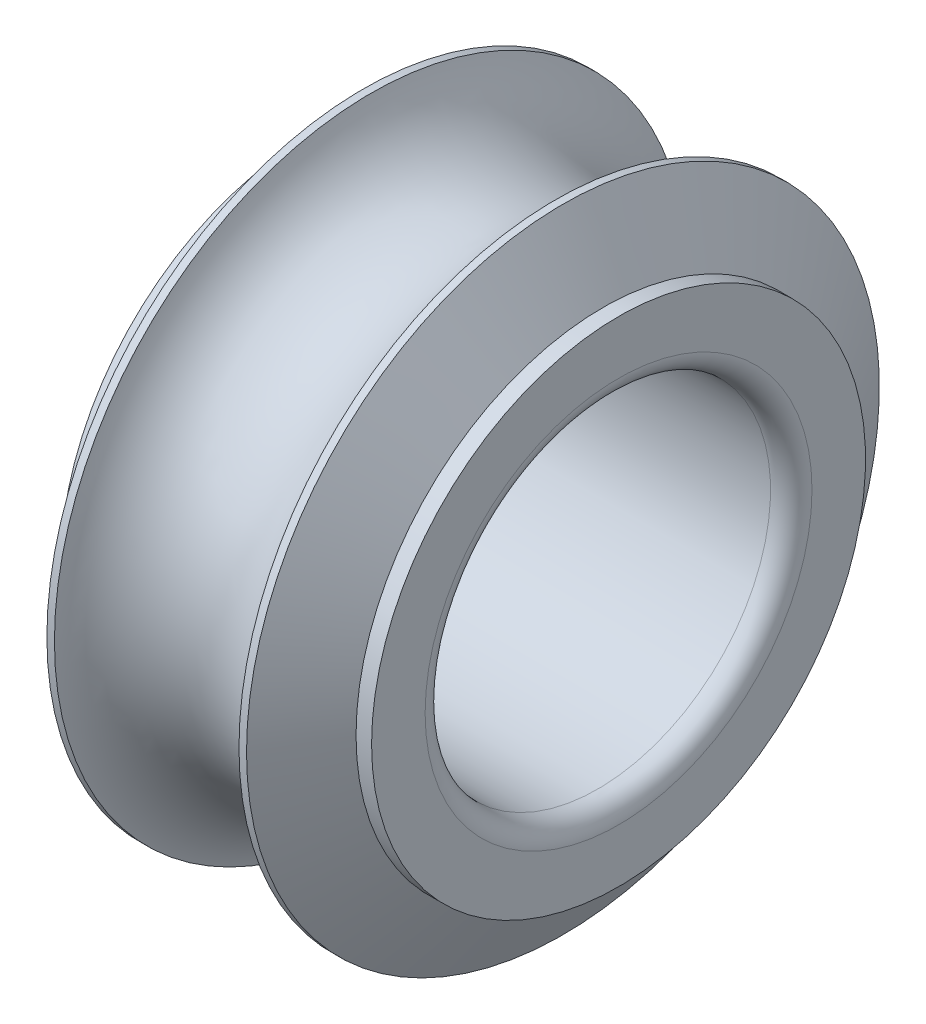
ISO-10303-21;
HEADER;
FILE_DESCRIPTION(('STEP AP214'),'2;1');
FILE_NAME('part.step','',(''),(''),'','','');
FILE_SCHEMA(('AUTOMOTIVE_DESIGN { 1 0 10303 214 1 1 1 1 }'));
ENDSEC;
DATA;
#1=APPLICATION_CONTEXT('core data for automotive mechanical design processes');
#2=APPLICATION_PROTOCOL_DEFINITION('international standard','automotive_design',2000,#1);
#3=PRODUCT_CONTEXT('',#1,'mechanical');
#4=PRODUCT('Part','Part','',(#3));
#5=PRODUCT_RELATED_PRODUCT_CATEGORY('part','',(#4));
#6=PRODUCT_DEFINITION_FORMATION('','',#4);
#7=PRODUCT_DEFINITION_CONTEXT('part definition',#1,'design');
#8=PRODUCT_DEFINITION('design','',#6,#7);
#9=PRODUCT_DEFINITION_SHAPE('','',#8);
#10=(LENGTH_UNIT() NAMED_UNIT(*) SI_UNIT(.MILLI.,.METRE.));
#11=(NAMED_UNIT(*) PLANE_ANGLE_UNIT() SI_UNIT($,.RADIAN.));
#12=(NAMED_UNIT(*) SI_UNIT($,.STERADIAN.) SOLID_ANGLE_UNIT());
#13=UNCERTAINTY_MEASURE_WITH_UNIT(LENGTH_MEASURE(1.E-05),#10,'distance_accuracy_value','');
#14=(GEOMETRIC_REPRESENTATION_CONTEXT(3) GLOBAL_UNCERTAINTY_ASSIGNED_CONTEXT((#13)) GLOBAL_UNIT_ASSIGNED_CONTEXT((#10,
#11,#12)) REPRESENTATION_CONTEXT('',''));
#15=CARTESIAN_POINT('',(0.,0.,0.));
#16=DIRECTION('',(0.,0.,1.));
#17=DIRECTION('',(1.,0.,0.));
#18=AXIS2_PLACEMENT_3D('',#15,#16,#17);
#19=CARTESIAN_POINT('',(8.4,0.,0.));
#20=DIRECTION('',(-1.,0.,0.));
#21=DIRECTION('',(0.,0.,1.));
#22=AXIS2_PLACEMENT_3D('',#19,#20,#21);
#23=TOROIDAL_SURFACE('',#22,5.6,0.6);
#24=CARTESIAN_POINT('',(9.,0.,0.));
#25=DIRECTION('',(-1.,0.,0.));
#26=DIRECTION('',(0.,0.,1.));
#27=AXIS2_PLACEMENT_3D('',#24,#25,#26);
#28=CIRCLE('',#27,5.6);
#29=CARTESIAN_POINT('',(9.,0.,5.6));
#30=VERTEX_POINT('',#29);
#31=EDGE_CURVE('E10',#30,#30,#28,.T.);
#32=ORIENTED_EDGE('',*,*,#31,.F.);
#33=EDGE_LOOP('',(#32));
#34=FACE_BOUND('',#33,.T.);
#35=CARTESIAN_POINT('',(8.4,0.,0.));
#36=DIRECTION('',(-1.,0.,0.));
#37=DIRECTION('',(0.,0.,1.));
#38=AXIS2_PLACEMENT_3D('',#35,#36,#37);
#39=CIRCLE('',#38,5.);
#40=CARTESIAN_POINT('',(8.4,0.,5.));
#41=VERTEX_POINT('',#40);
#42=EDGE_CURVE('E72',#41,#41,#39,.T.);
#43=ORIENTED_EDGE('',*,*,#42,.T.);
#44=EDGE_LOOP('',(#43));
#45=FACE_BOUND('',#44,.T.);
#46=ADVANCED_FACE('F14',(#34,#45),#23,.T.);
#47=CARTESIAN_POINT('',(9.,5.6,0.));
#48=DIRECTION('',(-1.,0.,0.));
#49=DIRECTION('',(0.,0.,1.));
#50=AXIS2_PLACEMENT_3D('',#47,#48,#49);
#51=PLANE('',#50);
#52=CARTESIAN_POINT('',(9.,0.,0.));
#53=DIRECTION('',(-1.,0.,0.));
#54=DIRECTION('',(0.,0.,1.));
#55=AXIS2_PLACEMENT_3D('',#52,#53,#54);
#56=CIRCLE('',#55,7.15);
#57=CARTESIAN_POINT('',(9.,0.,7.15));
#58=VERTEX_POINT('',#57);
#59=EDGE_CURVE('E21',#58,#58,#56,.T.);
#60=ORIENTED_EDGE('',*,*,#59,.F.);
#61=EDGE_LOOP('',(#60));
#62=FACE_BOUND('',#61,.T.);
#63=ORIENTED_EDGE('',*,*,#31,.T.);
#64=EDGE_LOOP('',(#63));
#65=FACE_BOUND('',#64,.T.);
#66=ADVANCED_FACE('F127',(#62,#65),#51,.F.);
#67=CARTESIAN_POINT('',(0.,0.,0.));
#68=DIRECTION('',(-1.,0.,0.));
#69=DIRECTION('',(0.,0.,1.));
#70=AXIS2_PLACEMENT_3D('',#67,#68,#69);
#71=CYLINDRICAL_SURFACE('',#70,7.15);
#72=CARTESIAN_POINT('',(8.55,0.,0.));
#73=DIRECTION('',(-1.,0.,0.));
#74=DIRECTION('',(0.,0.,1.));
#75=AXIS2_PLACEMENT_3D('',#72,#73,#74);
#76=CIRCLE('',#75,7.15);
#77=CARTESIAN_POINT('',(8.55,0.,7.15));
#78=VERTEX_POINT('',#77);
#79=EDGE_CURVE('E30',#78,#78,#76,.T.);
#80=ORIENTED_EDGE('',*,*,#79,.F.);
#81=EDGE_LOOP('',(#80));
#82=FACE_BOUND('',#81,.T.);
#83=ORIENTED_EDGE('',*,*,#59,.T.);
#84=EDGE_LOOP('',(#83));
#85=FACE_BOUND('',#84,.T.);
#86=ADVANCED_FACE('F132',(#82,#85),#71,.T.);
#87=CARTESIAN_POINT('',(8.55,0.,0.));
#88=DIRECTION('',(-1.,0.,0.));
#89=DIRECTION('',(0.,0.,1.));
#90=AXIS2_PLACEMENT_3D('',#87,#88,#89);
#91=CONICAL_SURFACE('',#90,7.15,1.0471975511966);
#92=CARTESIAN_POINT('',(7.38952595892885,0.,0.));
#93=DIRECTION('',(-1.,0.,0.));
#94=DIRECTION('',(0.,0.,1.));
#95=AXIS2_PLACEMENT_3D('',#92,#93,#94);
#96=CIRCLE('',#95,9.16);
#97=CARTESIAN_POINT('',(7.38952595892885,0.,9.16));
#98=VERTEX_POINT('',#97);
#99=EDGE_CURVE('E38',#98,#98,#96,.T.);
#100=ORIENTED_EDGE('',*,*,#99,.F.);
#101=EDGE_LOOP('',(#100));
#102=FACE_BOUND('',#101,.T.);
#103=ORIENTED_EDGE('',*,*,#79,.T.);
#104=EDGE_LOOP('',(#103));
#105=FACE_BOUND('',#104,.T.);
#106=ADVANCED_FACE('F123',(#102,#105),#91,.T.);
#107=CARTESIAN_POINT('',(0.,0.,0.));
#108=DIRECTION('',(-1.,0.,0.));
#109=DIRECTION('',(0.,0.,1.));
#110=AXIS2_PLACEMENT_3D('',#107,#108,#109);
#111=CYLINDRICAL_SURFACE('',#110,9.16);
#112=CARTESIAN_POINT('',(7.17102976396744,0.,0.));
#113=DIRECTION('',(-1.,0.,0.));
#114=DIRECTION('',(0.,0.,1.));
#115=AXIS2_PLACEMENT_3D('',#112,#113,#114);
#116=CIRCLE('',#115,9.16);
#117=CARTESIAN_POINT('',(7.17102976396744,0.,9.16));
#118=VERTEX_POINT('',#117);
#119=EDGE_CURVE('E44',#118,#118,#116,.T.);
#120=ORIENTED_EDGE('',*,*,#119,.F.);
#121=EDGE_LOOP('',(#120));
#122=FACE_BOUND('',#121,.T.);
#123=ORIENTED_EDGE('',*,*,#99,.T.);
#124=EDGE_LOOP('',(#123));
#125=FACE_BOUND('',#124,.T.);
#126=ADVANCED_FACE('F116',(#122,#125),#111,.T.);
#127=CARTESIAN_POINT('',(4.5,0.,0.));
#128=DIRECTION('',(-1.,0.,0.));
#129=DIRECTION('',(0.,0.,1.));
#130=AXIS2_PLACEMENT_3D('',#127,#128,#129);
#131=TOROIDAL_SURFACE('',#130,10.,2.8);
#132=ORIENTED_EDGE('',*,*,#119,.T.);
#133=EDGE_LOOP('',(#132));
#134=FACE_BOUND('',#133,.T.);
#135=CARTESIAN_POINT('',(1.82897023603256,0.,0.));
#136=DIRECTION('',(-1.,0.,0.));
#137=DIRECTION('',(0.,0.,1.));
#138=AXIS2_PLACEMENT_3D('',#135,#136,#137);
#139=CIRCLE('',#138,9.16);
#140=CARTESIAN_POINT('',(1.82897023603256,0.,9.16));
#141=VERTEX_POINT('',#140);
#142=EDGE_CURVE('E48',#141,#141,#139,.T.);
#143=ORIENTED_EDGE('',*,*,#142,.F.);
#144=EDGE_LOOP('',(#143));
#145=FACE_BOUND('',#144,.T.);
#146=ADVANCED_FACE('F111',(#134,#145),#131,.F.);
#147=CARTESIAN_POINT('',(0.,0.,0.));
#148=DIRECTION('',(-1.,0.,0.));
#149=DIRECTION('',(0.,0.,1.));
#150=AXIS2_PLACEMENT_3D('',#147,#148,#149);
#151=CYLINDRICAL_SURFACE('',#150,9.16);
#152=CARTESIAN_POINT('',(1.61047404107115,0.,0.));
#153=DIRECTION('',(-1.,0.,0.));
#154=DIRECTION('',(0.,0.,1.));
#155=AXIS2_PLACEMENT_3D('',#152,#153,#154);
#156=CIRCLE('',#155,9.16);
#157=CARTESIAN_POINT('',(1.61047404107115,0.,9.16));
#158=VERTEX_POINT('',#157);
#159=EDGE_CURVE('E52',#158,#158,#156,.T.);
#160=ORIENTED_EDGE('',*,*,#159,.F.);
#161=EDGE_LOOP('',(#160));
#162=FACE_BOUND('',#161,.T.);
#163=ORIENTED_EDGE('',*,*,#142,.T.);
#164=EDGE_LOOP('',(#163));
#165=FACE_BOUND('',#164,.T.);
#166=ADVANCED_FACE('F105',(#162,#165),#151,.T.);
#167=CARTESIAN_POINT('',(1.61047404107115,0.,0.));
#168=DIRECTION('',(1.,0.,0.));
#169=DIRECTION('',(0.,0.,-1.));
#170=AXIS2_PLACEMENT_3D('',#167,#168,#169);
#171=CONICAL_SURFACE('',#170,9.16,1.0471975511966);
#172=CARTESIAN_POINT('',(0.45,0.,0.));
#173=DIRECTION('',(-1.,0.,0.));
#174=DIRECTION('',(0.,0.,1.));
#175=AXIS2_PLACEMENT_3D('',#172,#173,#174);
#176=CIRCLE('',#175,7.15);
#177=CARTESIAN_POINT('',(0.45,0.,7.15));
#178=VERTEX_POINT('',#177);
#179=EDGE_CURVE('E56',#178,#178,#176,.T.);
#180=ORIENTED_EDGE('',*,*,#179,.F.);
#181=EDGE_LOOP('',(#180));
#182=FACE_BOUND('',#181,.T.);
#183=ORIENTED_EDGE('',*,*,#159,.T.);
#184=EDGE_LOOP('',(#183));
#185=FACE_BOUND('',#184,.T.);
#186=ADVANCED_FACE('F99',(#182,#185),#171,.T.);
#187=CARTESIAN_POINT('',(0.,0.,0.));
#188=DIRECTION('',(-1.,0.,0.));
#189=DIRECTION('',(0.,0.,1.));
#190=AXIS2_PLACEMENT_3D('',#187,#188,#189);
#191=CYLINDRICAL_SURFACE('',#190,7.15);
#192=CARTESIAN_POINT('',(0.,0.,0.));
#193=DIRECTION('',(-1.,0.,0.));
#194=DIRECTION('',(0.,0.,1.));
#195=AXIS2_PLACEMENT_3D('',#192,#193,#194);
#196=CIRCLE('',#195,7.15);
#197=CARTESIAN_POINT('',(0.,0.,7.15));
#198=VERTEX_POINT('',#197);
#199=EDGE_CURVE('E60',#198,#198,#196,.T.);
#200=ORIENTED_EDGE('',*,*,#199,.F.);
#201=EDGE_LOOP('',(#200));
#202=FACE_BOUND('',#201,.T.);
#203=ORIENTED_EDGE('',*,*,#179,.T.);
#204=EDGE_LOOP('',(#203));
#205=FACE_BOUND('',#204,.T.);
#206=ADVANCED_FACE('F93',(#202,#205),#191,.T.);
#207=CARTESIAN_POINT('',(0.,7.15,0.));
#208=DIRECTION('',(1.,0.,0.));
#209=DIRECTION('',(0.,0.,-1.));
#210=AXIS2_PLACEMENT_3D('',#207,#208,#209);
#211=PLANE('',#210);
#212=CARTESIAN_POINT('',(0.,0.,0.));
#213=DIRECTION('',(-1.,0.,0.));
#214=DIRECTION('',(0.,0.,1.));
#215=AXIS2_PLACEMENT_3D('',#212,#213,#214);
#216=CIRCLE('',#215,5.6);
#217=CARTESIAN_POINT('',(0.,0.,5.6));
#218=VERTEX_POINT('',#217);
#219=EDGE_CURVE('E64',#218,#218,#216,.T.);
#220=ORIENTED_EDGE('',*,*,#219,.F.);
#221=EDGE_LOOP('',(#220));
#222=FACE_BOUND('',#221,.T.);
#223=ORIENTED_EDGE('',*,*,#199,.T.);
#224=EDGE_LOOP('',(#223));
#225=FACE_BOUND('',#224,.T.);
#226=ADVANCED_FACE('F87',(#222,#225),#211,.F.);
#227=CARTESIAN_POINT('',(0.6,0.,0.));
#228=DIRECTION('',(-1.,0.,0.));
#229=DIRECTION('',(0.,0.,1.));
#230=AXIS2_PLACEMENT_3D('',#227,#228,#229);
#231=TOROIDAL_SURFACE('',#230,5.6,0.6);
#232=CARTESIAN_POINT('',(0.6,0.,0.));
#233=DIRECTION('',(-1.,0.,0.));
#234=DIRECTION('',(0.,0.,1.));
#235=AXIS2_PLACEMENT_3D('',#232,#233,#234);
#236=CIRCLE('',#235,5.);
#237=CARTESIAN_POINT('',(0.6,0.,5.));
#238=VERTEX_POINT('',#237);
#239=EDGE_CURVE('E68',#238,#238,#236,.T.);
#240=ORIENTED_EDGE('',*,*,#239,.F.);
#241=EDGE_LOOP('',(#240));
#242=FACE_BOUND('',#241,.T.);
#243=ORIENTED_EDGE('',*,*,#219,.T.);
#244=EDGE_LOOP('',(#243));
#245=FACE_BOUND('',#244,.T.);
#246=ADVANCED_FACE('F81',(#242,#245),#231,.T.);
#247=CARTESIAN_POINT('',(0.,0.,0.));
#248=DIRECTION('',(-1.,0.,0.));
#249=DIRECTION('',(0.,0.,1.));
#250=AXIS2_PLACEMENT_3D('',#247,#248,#249);
#251=CYLINDRICAL_SURFACE('',#250,5.);
#252=ORIENTED_EDGE('',*,*,#42,.F.);
#253=EDGE_LOOP('',(#252));
#254=FACE_BOUND('',#253,.T.);
#255=ORIENTED_EDGE('',*,*,#239,.T.);
#256=EDGE_LOOP('',(#255));
#257=FACE_BOUND('',#256,.T.);
#258=ADVANCED_FACE('F78',(#254,#257),#251,.F.);
#259=CLOSED_SHELL('',(#46,#66,#86,#106,#126,#146,#166,#186,#206,#226,#246,#258));
#260=MANIFOLD_SOLID_BREP('B1',#259);
#261=ADVANCED_BREP_SHAPE_REPRESENTATION('',(#18,#260),#14);
#262=SHAPE_DEFINITION_REPRESENTATION(#9,#261);
ENDSEC;
END-ISO-10303-21;
